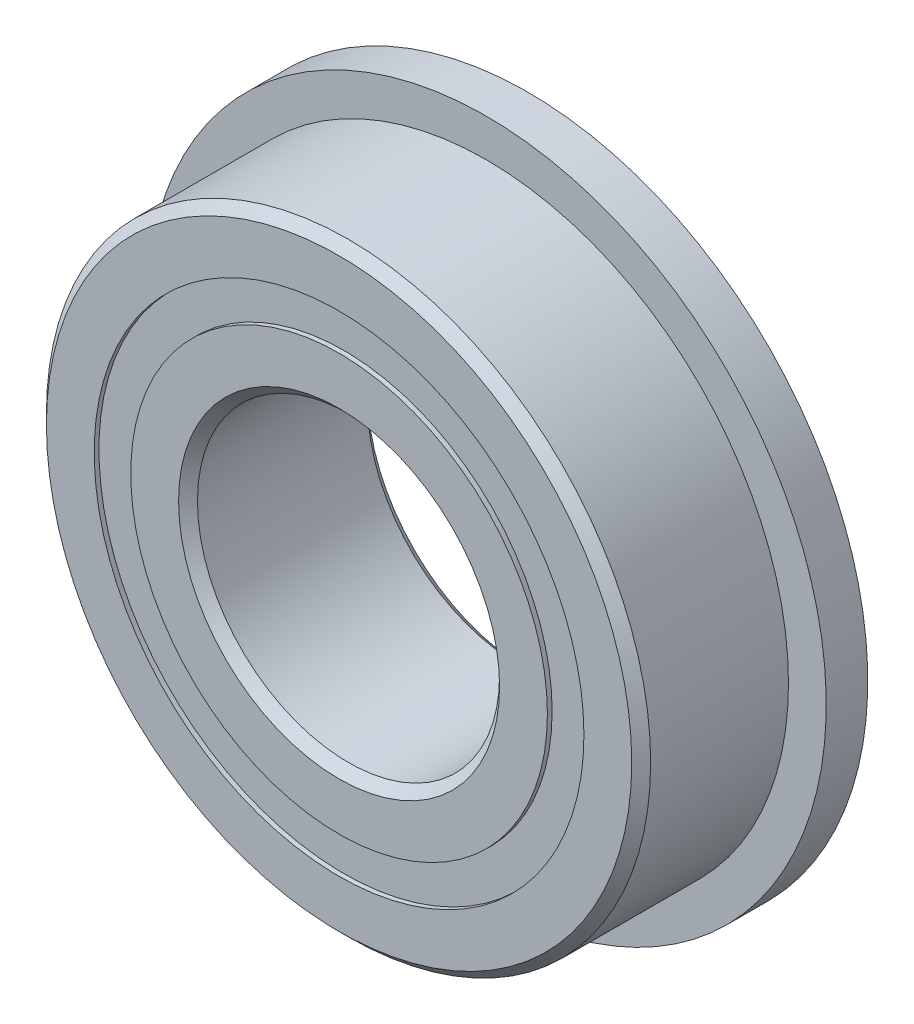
from build123d import *

# Parameters (mm, degrees)
CIRPATTERN1_COUNT = 12
SKETCH5_W         = 1.163242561
SKETCH5_H         = 0.967032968
SKETCH6_W         = 1.1
SKETCH6_H         = 2.516483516


with BuildPart() as part:
    # Sketch1 → Revolve1 (revolve)
    with BuildSketch(Plane(origin=(0, 0, 0), x_dir=(0, 0, -1), z_dir=(1, 0, 0)), mode=Mode.PRIVATE) as revolve1_sk:
        with BuildLine():
            Line((2.25, 8), (-2.25, 8))
            Line((-2.25, 8), (-2.5, 7.75))
            Line((-2.5, 7.75), (-2.5, 6.483516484))
            Line((-2.5, 6.483516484), (-1.111111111, 6.483516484))
            ThreePointArc((-1.111111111, 6.483516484), (0, 7.211757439), (1.111111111, 6.483516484))
            Line((1.111111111, 6.483516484), (2.5, 6.483516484))
            Line((2.5, 6.483516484), (2.5, 7.75))
            Line((2.5, 7.75), (2.25, 8))
        make_face()
    revolve(revolve1_sk.sketch.rotate(Axis((0, 0, 2.5), (0, 0, -1)), 90), axis=Axis((0, 0, 2.5), (0, 0, -1)))

    # Sketch6 → Revolve6 (revolve)
    with BuildSketch(Plane(origin=(0, 0, 0), x_dir=(0, 0, -1), z_dir=(1, 0, 0)), mode=Mode.PRIVATE) as revolve6_sk:
        with Locations((1.95, 7.741758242)):
            Rectangle(SKETCH6_W, SKETCH6_H)
    revolve(revolve6_sk.sketch.rotate(Axis((0, 0, -2.5), (0, 0, 1)), 270), axis=Axis((0, 0, -2.5), (0, 0, 1)))


with BuildPart() as body_2:
    # Sketch3 → Revolve3 (revolve)
    with BuildSketch(Plane(origin=(0, 0, 0), x_dir=(0, 0, -1), z_dir=(1, 0, 0)), mode=Mode.PRIVATE) as revolve3_sk:
        with BuildLine():
            Line((-2.5, 5.516483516), (-1.111111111, 5.516483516))
            ThreePointArc((-1.111111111, 5.516483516), (0, 4.788242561), (1.111111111, 5.516483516))
            Line((1.111111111, 5.516483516), (2.5, 5.516483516))
            Line((2.5, 5.516483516), (2.5, 4.25))
            Line((2.5, 4.25), (2.25, 4))
            Line((2.25, 4), (-2.25, 4))
            Line((-2.25, 4), (-2.5, 4.25))
            Line((-2.5, 4.25), (-2.5, 5.516483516))
        make_face()
    revolve(revolve3_sk.sketch.rotate(Axis((0, 0, 2.5), (0, 0, -1)), 90), axis=Axis((0, 0, 2.5), (0, 0, -1)))


with BuildPart() as body_3:
    # Sketch4 → Revolve4 (revolve)
    with BuildSketch(Plane(origin=(0, 0, 0), x_dir=(0, 0, -1), z_dir=(1, 0, 0))):
        with BuildLine():
            Line((-1.211757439, 6), (1.211757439, 6))
            ThreePointArc((1.211757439, 6), (0, 7.211757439), (-1.211757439, 6))
        make_face()
    revolve(axis=Axis((0, 6, 1.211757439), (0, 0, -1)))


with BuildPart() as cirpattern1_1:
    # CirPattern1: pattern copy
    add(body_3.part.rotate(Axis((0, 0, 0), (0, 0, 1)), 1 * 360 / CIRPATTERN1_COUNT))


with BuildPart() as cirpattern1_2:
    # CirPattern1: pattern copy
    add(body_3.part.rotate(Axis((0, 0, 0), (0, 0, 1)), 2 * 360 / CIRPATTERN1_COUNT))


with BuildPart() as cirpattern1_3:
    # CirPattern1: pattern copy
    add(body_3.part.rotate(Axis((0, 0, 0), (0, 0, 1)), 3 * 360 / CIRPATTERN1_COUNT))


with BuildPart() as cirpattern1_4:
    # CirPattern1: pattern copy
    add(body_3.part.rotate(Axis((0, 0, 0), (0, 0, 1)), 4 * 360 / CIRPATTERN1_COUNT))


with BuildPart() as cirpattern1_5:
    # CirPattern1: pattern copy
    add(body_3.part.rotate(Axis((0, 0, 0), (0, 0, 1)), 5 * 360 / CIRPATTERN1_COUNT))


with BuildPart() as cirpattern1_6:
    # CirPattern1: pattern copy
    add(body_3.part.rotate(Axis((0, 0, 0), (0, 0, 1)), 6 * 360 / CIRPATTERN1_COUNT))


with BuildPart() as cirpattern1_7:
    # CirPattern1: pattern copy
    add(body_3.part.rotate(Axis((0, 0, 0), (0, 0, 1)), 7 * 360 / CIRPATTERN1_COUNT))


with BuildPart() as cirpattern1_8:
    # CirPattern1: pattern copy
    add(body_3.part.rotate(Axis((0, 0, 0), (0, 0, 1)), 8 * 360 / CIRPATTERN1_COUNT))


with BuildPart() as cirpattern1_9:
    # CirPattern1: pattern copy
    add(body_3.part.rotate(Axis((0, 0, 0), (0, 0, 1)), 9 * 360 / CIRPATTERN1_COUNT))


with BuildPart() as cirpattern1_10:
    # CirPattern1: pattern copy
    add(body_3.part.rotate(Axis((0, 0, 0), (0, 0, 1)), 10 * 360 / CIRPATTERN1_COUNT))


with BuildPart() as cirpattern1_11:
    # CirPattern1: pattern copy
    add(body_3.part.rotate(Axis((0, 0, 0), (0, 0, 1)), 11 * 360 / CIRPATTERN1_COUNT))


with BuildPart() as body_15:
    # Sketch5 → Revolve5 (revolve)
    with BuildSketch(Plane(origin=(0, 0, 0), x_dir=(0, 0, -1), z_dir=(1, 0, 0)), mode=Mode.PRIVATE) as revolve5_sk:
        with Locations((-1.79337872, 6)):
            Rectangle(SKETCH5_W, SKETCH5_H)
        with Locations((1.79337872, 6)):
            Rectangle(SKETCH5_W, SKETCH5_H)
    revolve(revolve5_sk.sketch.rotate(Axis((0, 0, 2.5), (0, 0, -1)), 90), axis=Axis((0, 0, 2.5), (0, 0, -1)))


solid = Compound([part.part, body_2.part, body_3.part, cirpattern1_1.part, cirpattern1_2.part, cirpattern1_3.part, cirpattern1_4.part, cirpattern1_5.part, cirpattern1_6.part, cirpattern1_7.part, cirpattern1_8.part, cirpattern1_9.part, cirpattern1_10.part, cirpattern1_11.part, body_15.part])
